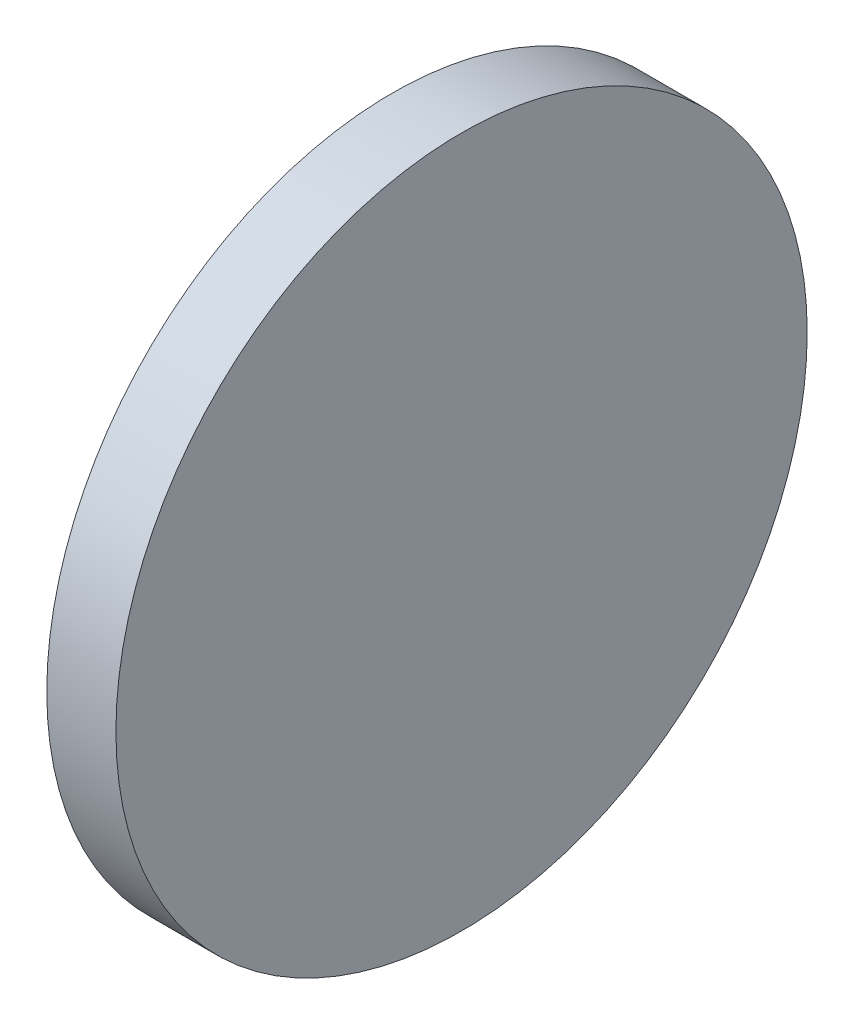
from build123d import *

# Parameters (mm, degrees)
SKETCH1_R      = 1.905
EXTRUDE1_DEPTH = 0.381


with BuildPart() as part:
    # Sketch1 → Extrude1 (new body)
    with BuildSketch(Plane(origin=(0, 0, 0), x_dir=(0, 0, -1), z_dir=(1, 0, 0))):
        with Locations(Location((0, 0, 0), (0, 0, 180))):
            Circle(SKETCH1_R)
    extrude(amount=EXTRUDE1_DEPTH)


solid = part.part
